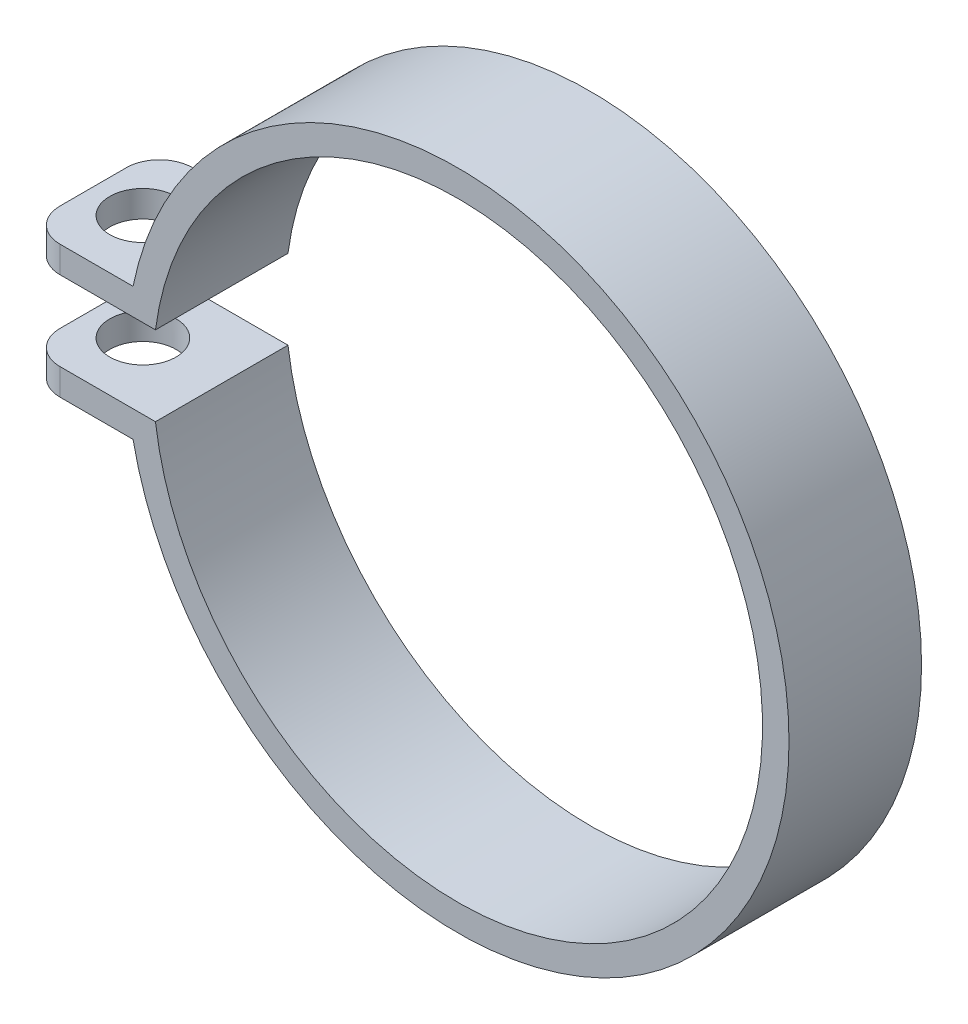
from build123d import *

# Parameters (mm, degrees)
BOSS_EXTRUDE1_DEPTH = 10
FILLET1_R           = 5
CUT_EXTRUDE1_REACH  = 91.022
SKETCH2_R           = 5


with BuildPart() as part:
    # Sketch1 → Boss-Extrude1 (new, symmetric)
    with BuildSketch(Plane.XY):
        with BuildLine():
            Line((-65, 10), (-48.989794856, 10))
            ThreePointArc((-48.989794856, 10), (50, 0), (-48.989794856, -10))
            Line((-48.989794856, -10), (-65, -10))
            Line((-65, -10), (-65, -6))
            Line((-65, -6), (-45.607017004, -6))
            ThreePointArc((-45.607017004, -6), (46, 0), (-45.607017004, 6))
            Line((-45.607017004, 6), (-65, 6))
            Line((-65, 6), (-65, 10))
        make_face()
    extrude(amount=BOSS_EXTRUDE1_DEPTH, both=True)

    # Fillet1
    fillet1_edges = [part.edges().sort_by_distance(p)[0] for p in [
        (-65, -8, 10),
        (-65, 8, 10),
        (-65, 8, -10),
        (-65, -8, -10),
    ]]
    fillet(fillet1_edges, radius=FILLET1_R)

    # Cut-Extrude1: up to this face of the body (flat: up to its plane)
    cut_extrude1_end = Plane(part.part.faces().sort_by_distance((-56.756067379, -10, 0))[0])
    # Sketch2 → Cut-Extrude1 (cut, up to the picked face)
    with BuildSketch(Plane(origin=(0, 10, 0), x_dir=(1, 0, 0), z_dir=(0, 1, 0)), mode=Mode.PRIVATE) as cut_extrude1_sk1:
        with Locations(Location((-57.5, 0, 0), (0, 0, 270))):
            Circle(SKETCH2_R)
    cut_extrude1_tool1 = split(extrude(cut_extrude1_sk1.sketch, amount=-CUT_EXTRUDE1_REACH, mode=Mode.PRIVATE), bisect_by=cut_extrude1_end, keep=Keep.BOTH, mode=Mode.PRIVATE)
    add(cut_extrude1_tool1.solids().sort_by(Axis((-57.5, 10, 0), (0, -1, 0)))[0], mode=Mode.SUBTRACT)


solid = part.part
